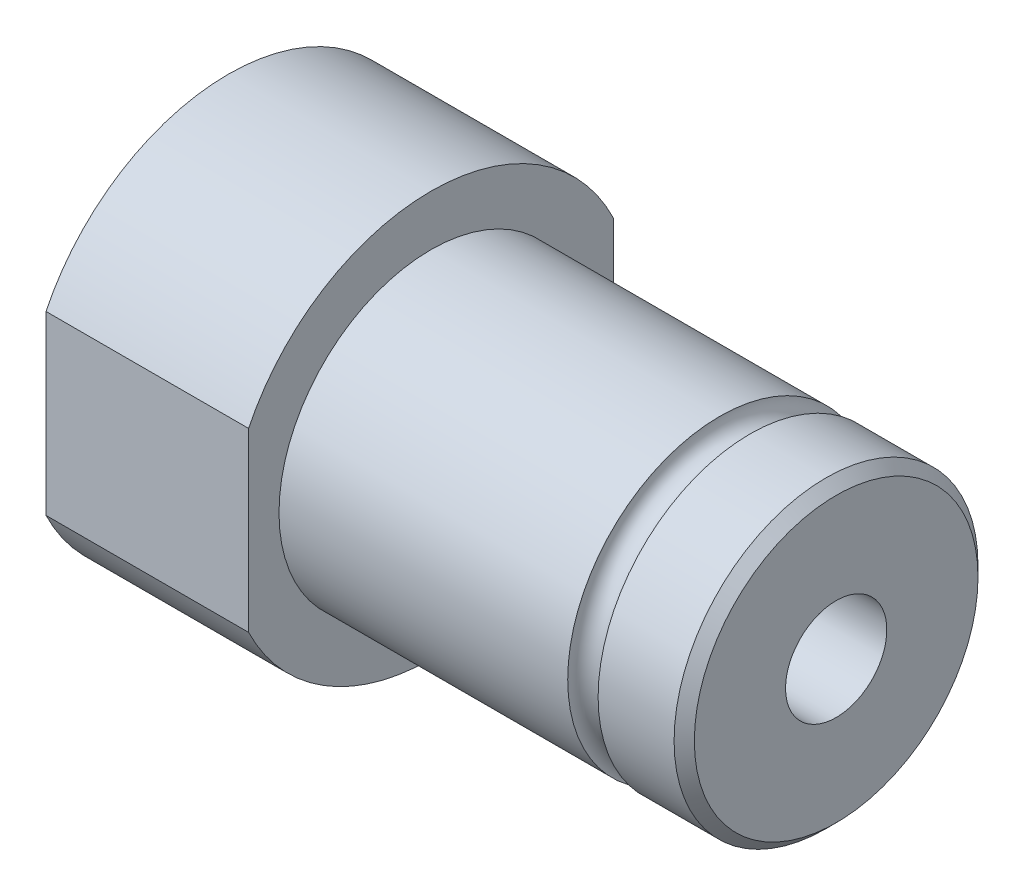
ISO-10303-21;
HEADER;
FILE_DESCRIPTION(('STEP AP214'),'2;1');
FILE_NAME('part.step','',(''),(''),'','','');
FILE_SCHEMA(('AUTOMOTIVE_DESIGN { 1 0 10303 214 1 1 1 1 }'));
ENDSEC;
DATA;
#1=APPLICATION_CONTEXT('core data for automotive mechanical design processes');
#2=APPLICATION_PROTOCOL_DEFINITION('international standard','automotive_design',2000,#1);
#3=PRODUCT_CONTEXT('',#1,'mechanical');
#4=PRODUCT('Part','Part','',(#3));
#5=PRODUCT_RELATED_PRODUCT_CATEGORY('part','',(#4));
#6=PRODUCT_DEFINITION_FORMATION('','',#4);
#7=PRODUCT_DEFINITION_CONTEXT('part definition',#1,'design');
#8=PRODUCT_DEFINITION('design','',#6,#7);
#9=PRODUCT_DEFINITION_SHAPE('','',#8);
#10=(LENGTH_UNIT() NAMED_UNIT(*) SI_UNIT(.MILLI.,.METRE.));
#11=(NAMED_UNIT(*) PLANE_ANGLE_UNIT() SI_UNIT($,.RADIAN.));
#12=(NAMED_UNIT(*) SI_UNIT($,.STERADIAN.) SOLID_ANGLE_UNIT());
#13=UNCERTAINTY_MEASURE_WITH_UNIT(LENGTH_MEASURE(1.E-05),#10,'distance_accuracy_value','');
#14=(GEOMETRIC_REPRESENTATION_CONTEXT(3) GLOBAL_UNCERTAINTY_ASSIGNED_CONTEXT((#13)) GLOBAL_UNIT_ASSIGNED_CONTEXT((#10,
#11,#12)) REPRESENTATION_CONTEXT('',''));
#15=CARTESIAN_POINT('',(0.,0.,0.));
#16=DIRECTION('',(0.,0.,1.));
#17=DIRECTION('',(1.,0.,0.));
#18=AXIS2_PLACEMENT_3D('',#15,#16,#17);
#19=CARTESIAN_POINT('',(20.,0.,0.));
#20=DIRECTION('',(1.,0.,0.));
#21=DIRECTION('',(0.,0.,-1.));
#22=AXIS2_PLACEMENT_3D('',#19,#20,#21);
#23=CYLINDRICAL_SURFACE('',#22,15.);
#24=CARTESIAN_POINT('',(20.,0.,0.));
#25=DIRECTION('',(1.,0.,0.));
#26=DIRECTION('',(0.,0.,-1.));
#27=AXIS2_PLACEMENT_3D('',#24,#25,#26);
#28=CIRCLE('',#27,15.);
#29=CARTESIAN_POINT('',(20.,0.,-15.));
#30=VERTEX_POINT('',#29);
#31=EDGE_CURVE('E161',#30,#30,#28,.T.);
#32=ORIENTED_EDGE('',*,*,#31,.T.);
#33=EDGE_LOOP('',(#32));
#34=FACE_BOUND('',#33,.T.);
#35=CARTESIAN_POINT('',(48.5,0.,0.));
#36=DIRECTION('',(1.,0.,0.));
#37=DIRECTION('',(0.,0.,-1.));
#38=AXIS2_PLACEMENT_3D('',#35,#36,#37);
#39=CIRCLE('',#38,15.);
#40=CARTESIAN_POINT('',(48.5,0.,-15.));
#41=VERTEX_POINT('',#40);
#42=EDGE_CURVE('E91',#41,#41,#39,.F.);
#43=ORIENTED_EDGE('',*,*,#42,.T.);
#44=EDGE_LOOP('',(#43));
#45=FACE_BOUND('',#44,.T.);
#46=ADVANCED_FACE('F33',(#34,#45),#23,.T.);
#47=CARTESIAN_POINT('',(59.,0.,0.));
#48=DIRECTION('',(1.,0.,0.));
#49=DIRECTION('',(0.,0.,-1.));
#50=AXIS2_PLACEMENT_3D('',#47,#48,#49);
#51=CIRCLE('',#50,15.);
#52=CARTESIAN_POINT('',(59.,0.,-15.));
#53=VERTEX_POINT('',#52);
#54=EDGE_CURVE('E12',#53,#53,#51,.F.);
#55=ORIENTED_EDGE('',*,*,#54,.T.);
#56=EDGE_LOOP('',(#55));
#57=FACE_BOUND('',#56,.T.);
#58=CARTESIAN_POINT('',(51.5,0.,0.));
#59=DIRECTION('',(-1.,0.,0.));
#60=DIRECTION('',(0.,0.,1.));
#61=AXIS2_PLACEMENT_3D('',#58,#59,#60);
#62=CIRCLE('',#61,15.);
#63=CARTESIAN_POINT('',(51.5,0.,15.));
#64=VERTEX_POINT('',#63);
#65=EDGE_CURVE('E106',#64,#64,#62,.F.);
#66=ORIENTED_EDGE('',*,*,#65,.T.);
#67=EDGE_LOOP('',(#66));
#68=FACE_BOUND('',#67,.T.);
#69=ADVANCED_FACE('F127',(#57,#68),#23,.T.);
#70=CARTESIAN_POINT('',(60.,0.,0.));
#71=DIRECTION('',(-1.,0.,0.));
#72=DIRECTION('',(0.,0.,1.));
#73=AXIS2_PLACEMENT_3D('',#70,#71,#72);
#74=CYLINDRICAL_SURFACE('',#73,20.);
#75=DIRECTION('',(-1.,0.,0.));
#76=VECTOR('',#75,1.);
#77=CARTESIAN_POINT('',(60.,-8.71779788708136,-18.));
#78=LINE('',#77,#76);
#79=CARTESIAN_POINT('',(20.,-8.71779788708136,-18.));
#80=VERTEX_POINT('',#79);
#81=CARTESIAN_POINT('',(0.,-8.71779788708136,-18.));
#82=VERTEX_POINT('',#81);
#83=EDGE_CURVE('E159',#80,#82,#78,.T.);
#84=ORIENTED_EDGE('',*,*,#83,.F.);
#85=CARTESIAN_POINT('',(20.,0.,0.));
#86=DIRECTION('',(1.,0.,0.));
#87=DIRECTION('',(0.,0.,-1.));
#88=AXIS2_PLACEMENT_3D('',#85,#86,#87);
#89=CIRCLE('',#88,20.);
#90=CARTESIAN_POINT('',(20.,-8.71779788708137,18.));
#91=VERTEX_POINT('',#90);
#92=EDGE_CURVE('E103',#91,#80,#89,.T.);
#93=ORIENTED_EDGE('',*,*,#92,.F.);
#94=DIRECTION('',(-1.,0.,0.));
#95=VECTOR('',#94,1.);
#96=CARTESIAN_POINT('',(60.,-8.71779788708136,18.));
#97=LINE('',#96,#95);
#98=CARTESIAN_POINT('',(0.,-8.71779788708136,18.));
#99=VERTEX_POINT('',#98);
#100=EDGE_CURVE('E48',#91,#99,#97,.T.);
#101=ORIENTED_EDGE('',*,*,#100,.T.);
#102=CARTESIAN_POINT('',(0.,0.,0.));
#103=DIRECTION('',(1.,0.,0.));
#104=DIRECTION('',(0.,0.,-1.));
#105=AXIS2_PLACEMENT_3D('',#102,#103,#104);
#106=CIRCLE('',#105,20.);
#107=EDGE_CURVE('E89',#99,#82,#106,.T.);
#108=ORIENTED_EDGE('',*,*,#107,.T.);
#109=EDGE_LOOP('',(#84,#93,#101,#108));
#110=FACE_BOUND('',#109,.T.);
#111=ADVANCED_FACE('F133',(#110),#74,.T.);
#112=DIRECTION('',(-1.,0.,0.));
#113=VECTOR('',#112,1.);
#114=CARTESIAN_POINT('',(60.,8.71779788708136,-18.));
#115=LINE('',#114,#113);
#116=CARTESIAN_POINT('',(20.,8.71779788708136,-18.));
#117=VERTEX_POINT('',#116);
#118=CARTESIAN_POINT('',(0.,8.71779788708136,-18.));
#119=VERTEX_POINT('',#118);
#120=EDGE_CURVE('E56',#117,#119,#115,.T.);
#121=ORIENTED_EDGE('',*,*,#120,.T.);
#122=CARTESIAN_POINT('',(0.,8.71779788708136,18.));
#123=VERTEX_POINT('',#122);
#124=EDGE_CURVE('E87',#119,#123,#106,.T.);
#125=ORIENTED_EDGE('',*,*,#124,.T.);
#126=DIRECTION('',(-1.,0.,0.));
#127=VECTOR('',#126,1.);
#128=CARTESIAN_POINT('',(60.,8.71779788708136,18.));
#129=LINE('',#128,#127);
#130=CARTESIAN_POINT('',(20.,8.71779788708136,18.));
#131=VERTEX_POINT('',#130);
#132=EDGE_CURVE('E72',#131,#123,#129,.T.);
#133=ORIENTED_EDGE('',*,*,#132,.F.);
#134=EDGE_CURVE('E102',#117,#131,#89,.T.);
#135=ORIENTED_EDGE('',*,*,#134,.F.);
#136=EDGE_LOOP('',(#121,#125,#133,#135));
#137=FACE_BOUND('',#136,.T.);
#138=ADVANCED_FACE('F93',(#137),#74,.T.);
#139=CARTESIAN_POINT('',(0.,0.,0.));
#140=DIRECTION('',(1.,0.,0.));
#141=DIRECTION('',(0.,0.,-1.));
#142=AXIS2_PLACEMENT_3D('',#139,#140,#141);
#143=PLANE('',#142);
#144=CARTESIAN_POINT('',(0.,0.,0.));
#145=DIRECTION('',(-1.,0.,0.));
#146=DIRECTION('',(0.,0.,1.));
#147=AXIS2_PLACEMENT_3D('',#144,#145,#146);
#148=CIRCLE('',#147,5.);
#149=CARTESIAN_POINT('',(0.,0.,5.));
#150=VERTEX_POINT('',#149);
#151=EDGE_CURVE('E100',#150,#150,#148,.T.);
#152=ORIENTED_EDGE('',*,*,#151,.F.);
#153=EDGE_LOOP('',(#152));
#154=FACE_BOUND('',#153,.T.);
#155=DIRECTION('',(0.,-1.,0.));
#156=VECTOR('',#155,1.);
#157=CARTESIAN_POINT('',(0.,-8.71779788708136,-18.));
#158=LINE('',#157,#156);
#159=EDGE_CURVE('E90',#119,#82,#158,.T.);
#160=ORIENTED_EDGE('',*,*,#159,.T.);
#161=ORIENTED_EDGE('',*,*,#107,.F.);
#162=DIRECTION('',(0.,1.,0.));
#163=VECTOR('',#162,1.);
#164=CARTESIAN_POINT('',(0.,-8.71779788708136,18.));
#165=LINE('',#164,#163);
#166=EDGE_CURVE('E75',#99,#123,#165,.T.);
#167=ORIENTED_EDGE('',*,*,#166,.T.);
#168=ORIENTED_EDGE('',*,*,#124,.F.);
#169=EDGE_LOOP('',(#160,#161,#167,#168));
#170=FACE_BOUND('',#169,.T.);
#171=ADVANCED_FACE('F86',(#154,#170),#143,.F.);
#172=CARTESIAN_POINT('',(20.,0.,0.));
#173=DIRECTION('',(1.,0.,0.));
#174=DIRECTION('',(0.,0.,-1.));
#175=AXIS2_PLACEMENT_3D('',#172,#173,#174);
#176=PLANE('',#175);
#177=ORIENTED_EDGE('',*,*,#31,.F.);
#178=EDGE_LOOP('',(#177));
#179=FACE_BOUND('',#178,.T.);
#180=ORIENTED_EDGE('',*,*,#92,.T.);
#181=DIRECTION('',(0.,1.,0.));
#182=VECTOR('',#181,1.);
#183=CARTESIAN_POINT('',(20.,0.,-18.));
#184=LINE('',#183,#182);
#185=EDGE_CURVE('E95',#80,#117,#184,.T.);
#186=ORIENTED_EDGE('',*,*,#185,.T.);
#187=ORIENTED_EDGE('',*,*,#134,.T.);
#188=DIRECTION('',(0.,-1.,0.));
#189=VECTOR('',#188,1.);
#190=CARTESIAN_POINT('',(20.,0.,18.));
#191=LINE('',#190,#189);
#192=EDGE_CURVE('E76',#131,#91,#191,.T.);
#193=ORIENTED_EDGE('',*,*,#192,.T.);
#194=EDGE_LOOP('',(#180,#186,#187,#193));
#195=FACE_BOUND('',#194,.T.);
#196=ADVANCED_FACE('F140',(#179,#195),#176,.T.);
#197=CARTESIAN_POINT('',(60.,0.,0.));
#198=DIRECTION('',(1.,0.,0.));
#199=DIRECTION('',(0.,0.,-1.));
#200=AXIS2_PLACEMENT_3D('',#197,#198,#199);
#201=PLANE('',#200);
#202=CARTESIAN_POINT('',(60.,0.,0.));
#203=DIRECTION('',(1.,0.,0.));
#204=DIRECTION('',(0.,0.,-1.));
#205=AXIS2_PLACEMENT_3D('',#202,#203,#204);
#206=CIRCLE('',#205,14.);
#207=CARTESIAN_POINT('',(60.,0.,-14.));
#208=VERTEX_POINT('',#207);
#209=EDGE_CURVE('E41',#208,#208,#206,.T.);
#210=ORIENTED_EDGE('',*,*,#209,.T.);
#211=EDGE_LOOP('',(#210));
#212=FACE_BOUND('',#211,.T.);
#213=CARTESIAN_POINT('',(60.,0.,0.));
#214=DIRECTION('',(-1.,0.,0.));
#215=DIRECTION('',(0.,0.,1.));
#216=AXIS2_PLACEMENT_3D('',#213,#214,#215);
#217=CIRCLE('',#216,5.);
#218=CARTESIAN_POINT('',(60.,0.,5.));
#219=VERTEX_POINT('',#218);
#220=EDGE_CURVE('E97',#219,#219,#217,.T.);
#221=ORIENTED_EDGE('',*,*,#220,.T.);
#222=EDGE_LOOP('',(#221));
#223=FACE_BOUND('',#222,.T.);
#224=ADVANCED_FACE('F113',(#212,#223),#201,.T.);
#225=CARTESIAN_POINT('',(60.,0.,0.));
#226=DIRECTION('',(-1.,0.,0.));
#227=DIRECTION('',(0.,0.,1.));
#228=AXIS2_PLACEMENT_3D('',#225,#226,#227);
#229=CYLINDRICAL_SURFACE('',#228,5.);
#230=ORIENTED_EDGE('',*,*,#220,.F.);
#231=EDGE_LOOP('',(#230));
#232=FACE_BOUND('',#231,.T.);
#233=ORIENTED_EDGE('',*,*,#151,.T.);
#234=EDGE_LOOP('',(#233));
#235=FACE_BOUND('',#234,.T.);
#236=ADVANCED_FACE('F144',(#232,#235),#229,.F.);
#237=CARTESIAN_POINT('',(60.,-8.71779788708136,18.));
#238=DIRECTION('',(0.,0.,1.));
#239=DIRECTION('',(1.,0.,0.));
#240=AXIS2_PLACEMENT_3D('',#237,#238,#239);
#241=PLANE('',#240);
#242=ORIENTED_EDGE('',*,*,#132,.T.);
#243=ORIENTED_EDGE('',*,*,#166,.F.);
#244=ORIENTED_EDGE('',*,*,#100,.F.);
#245=ORIENTED_EDGE('',*,*,#192,.F.);
#246=EDGE_LOOP('',(#242,#243,#244,#245));
#247=FACE_BOUND('',#246,.T.);
#248=ADVANCED_FACE('F74',(#247),#241,.T.);
#249=CARTESIAN_POINT('',(60.,-8.71779788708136,-18.));
#250=DIRECTION('',(0.,0.,-1.));
#251=DIRECTION('',(-1.,0.,0.));
#252=AXIS2_PLACEMENT_3D('',#249,#250,#251);
#253=PLANE('',#252);
#254=ORIENTED_EDGE('',*,*,#83,.T.);
#255=ORIENTED_EDGE('',*,*,#159,.F.);
#256=ORIENTED_EDGE('',*,*,#120,.F.);
#257=ORIENTED_EDGE('',*,*,#185,.F.);
#258=EDGE_LOOP('',(#254,#255,#256,#257));
#259=FACE_BOUND('',#258,.T.);
#260=ADVANCED_FACE('F122',(#259),#253,.T.);
#261=CARTESIAN_POINT('',(50.,0.,0.));
#262=DIRECTION('',(-1.,0.,0.));
#263=DIRECTION('',(0.,0.,1.));
#264=AXIS2_PLACEMENT_3D('',#261,#262,#263);
#265=TOROIDAL_SURFACE('',#264,15.,1.5);
#266=ORIENTED_EDGE('',*,*,#42,.F.);
#267=EDGE_LOOP('',(#266));
#268=FACE_BOUND('',#267,.T.);
#269=ORIENTED_EDGE('',*,*,#65,.F.);
#270=EDGE_LOOP('',(#269));
#271=FACE_BOUND('',#270,.T.);
#272=ADVANCED_FACE('F117',(#268,#271),#265,.F.);
#273=CARTESIAN_POINT('',(60.,0.,0.));
#274=DIRECTION('',(-1.,0.,0.));
#275=DIRECTION('',(0.,0.,1.));
#276=AXIS2_PLACEMENT_3D('',#273,#274,#275);
#277=CONICAL_SURFACE('',#276,14.,0.785398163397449);
#278=ORIENTED_EDGE('',*,*,#54,.F.);
#279=EDGE_LOOP('',(#278));
#280=FACE_BOUND('',#279,.T.);
#281=ORIENTED_EDGE('',*,*,#209,.F.);
#282=EDGE_LOOP('',(#281));
#283=FACE_BOUND('',#282,.T.);
#284=ADVANCED_FACE('F35',(#280,#283),#277,.T.);
#285=CLOSED_SHELL('',(#46,#69,#111,#138,#171,#196,#224,#236,#248,#260,#272,#284));
#286=MANIFOLD_SOLID_BREP('B2',#285);
#287=ADVANCED_BREP_SHAPE_REPRESENTATION('',(#18,#286),#14);
#288=SHAPE_DEFINITION_REPRESENTATION(#9,#287);
ENDSEC;
END-ISO-10303-21;
